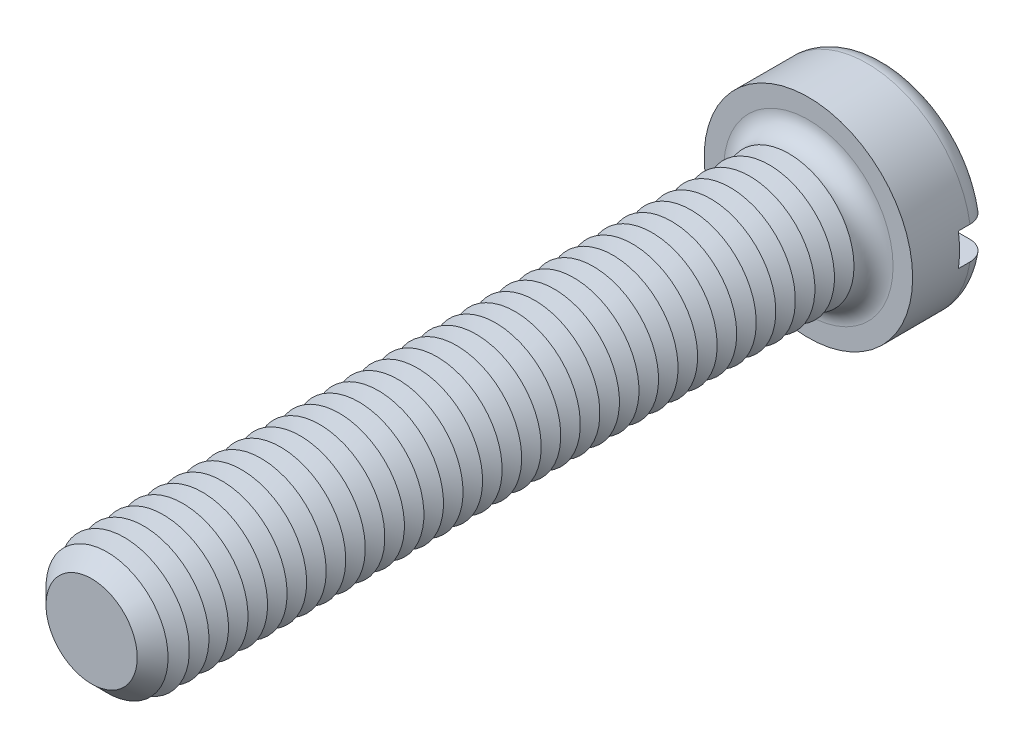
from build123d import *

# Parameters (mm, degrees)
SKETCH3_R           = 8
BOSS_EXTRUDE2_DEPTH = 6
SKETCH4_R           = 5
BOSS_EXTRUDE3_DEPTH = 55
FILLET1_R           = 1.5
CHAMFER1_SIZE       = 1.5
LPATTERN1_COUNT     = 35
LPATTERN1_PITCH     = 1.5
SKETCH8_W           = 16
SKETCH8_H           = 2.5
CUT_EXTRUDE1_DEPTH  = 2.4


with BuildPart() as part:
    # Sketch3 → Boss-Extrude2 (new body)
    with BuildSketch(Plane.XY):
        Circle(SKETCH3_R)
    extrude(amount=-BOSS_EXTRUDE2_DEPTH)

    # Sketch4 → Boss-Extrude3 (add)
    with BuildSketch(Plane.XY):
        Circle(SKETCH4_R)
    extrude(amount=BOSS_EXTRUDE3_DEPTH)

    # Fillet1
    fillet1_edges = [part.edges().sort_by_distance(p)[0] for p in [
        (-8, 0, -6),
        (-5, 0, 0),
    ]]
    fillet(fillet1_edges, radius=FILLET1_R)

    # Chamfer1
    chamfer1_edges = [part.edges().sort_by_distance(p)[0] for p in [
        (-5, 0, 55),
    ]]
    chamfer(chamfer1_edges, length=CHAMFER1_SIZE)

    # Sketch6 → Cut-Revolve1 (revolve, cut)
    with BuildSketch(Plane(origin=(0, 0, 0), x_dir=(0, 0, -1), z_dir=(1, 0, 0)), mode=Mode.PRIVATE) as cut_revolve1_sk:
        Polygon((-1.5, 5), (-2.25, 3.700961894), (-3, 5), align=None)
    cut_revolve1 = revolve(cut_revolve1_sk.sketch.rotate(Axis((0, 0, -1.694361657), (0, 0, 1)), 90), axis=Axis((0, 0, -1.694361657), (0, 0, 1)), mode=Mode.SUBTRACT)

    # LPattern1: Cut-Revolve1 ×35
    with Locations(*[(0, 0, i * LPATTERN1_PITCH) for i in range(1, LPATTERN1_COUNT)]):
        add(cut_revolve1, mode=Mode.SUBTRACT)

    # Sketch8 → Cut-Extrude1 (cut)
    with BuildSketch(Plane(origin=(0, 0, -6), x_dir=(-1, 0, 0), z_dir=(0, 0, -1))):
        Rectangle(SKETCH8_W, SKETCH8_H)
    extrude(amount=-CUT_EXTRUDE1_DEPTH, mode=Mode.SUBTRACT)


solid = part.part
